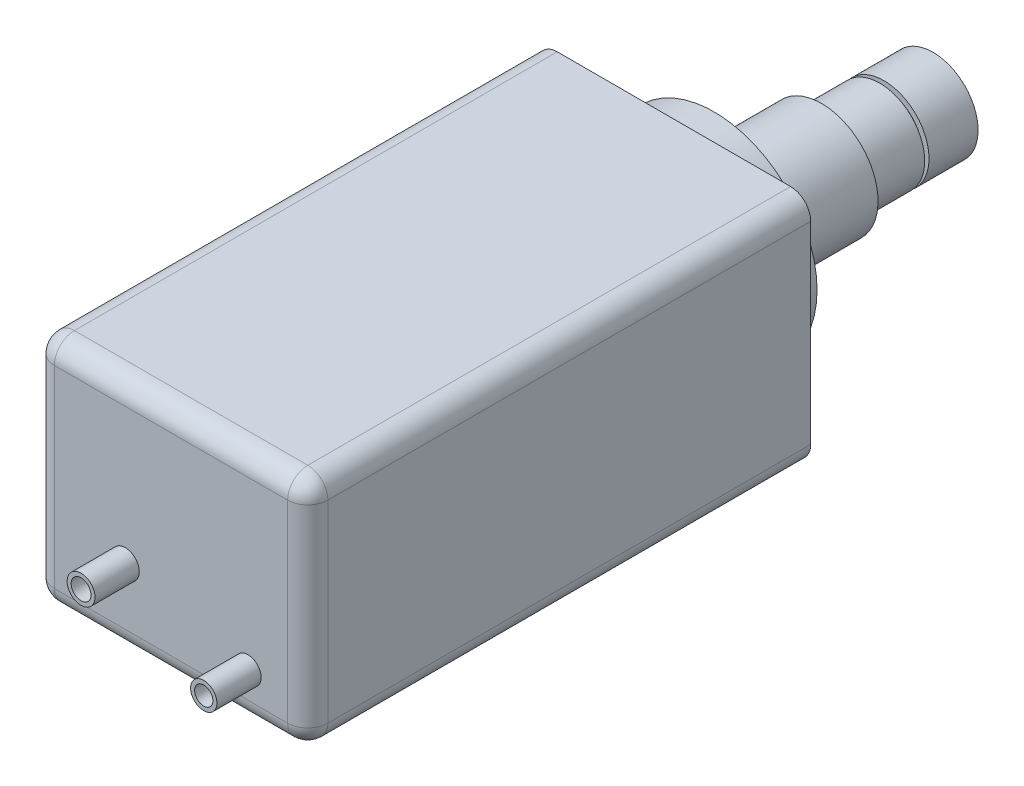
ISO-10303-21;
HEADER;
FILE_DESCRIPTION(('STEP AP214'),'2;1');
FILE_NAME('part.step','',(''),(''),'','','');
FILE_SCHEMA(('AUTOMOTIVE_DESIGN { 1 0 10303 214 1 1 1 1 }'));
ENDSEC;
DATA;
#1=APPLICATION_CONTEXT('core data for automotive mechanical design processes');
#2=APPLICATION_PROTOCOL_DEFINITION('international standard','automotive_design',2000,#1);
#3=PRODUCT_CONTEXT('',#1,'mechanical');
#4=PRODUCT('Part','Part','',(#3));
#5=PRODUCT_RELATED_PRODUCT_CATEGORY('part','',(#4));
#6=PRODUCT_DEFINITION_FORMATION('','',#4);
#7=PRODUCT_DEFINITION_CONTEXT('part definition',#1,'design');
#8=PRODUCT_DEFINITION('design','',#6,#7);
#9=PRODUCT_DEFINITION_SHAPE('','',#8);
#10=(LENGTH_UNIT() NAMED_UNIT(*) SI_UNIT(.MILLI.,.METRE.));
#11=(NAMED_UNIT(*) PLANE_ANGLE_UNIT() SI_UNIT($,.RADIAN.));
#12=(NAMED_UNIT(*) SI_UNIT($,.STERADIAN.) SOLID_ANGLE_UNIT());
#13=UNCERTAINTY_MEASURE_WITH_UNIT(LENGTH_MEASURE(1.E-05),#10,'distance_accuracy_value','');
#14=(GEOMETRIC_REPRESENTATION_CONTEXT(3) GLOBAL_UNCERTAINTY_ASSIGNED_CONTEXT((#13)) GLOBAL_UNIT_ASSIGNED_CONTEXT((#10,
#11,#12)) REPRESENTATION_CONTEXT('',''));
#15=CARTESIAN_POINT('',(0.,0.,0.));
#16=DIRECTION('',(0.,0.,1.));
#17=DIRECTION('',(1.,0.,0.));
#18=AXIS2_PLACEMENT_3D('',#15,#16,#17);
#19=CARTESIAN_POINT('',(-34.,-29.,125.));
#20=DIRECTION('',(0.,0.,1.));
#21=DIRECTION('',(1.,0.,0.));
#22=AXIS2_PLACEMENT_3D('',#19,#20,#21);
#23=PLANE('',#22);
#24=DIRECTION('',(0.,1.,0.));
#25=VECTOR('',#24,1.);
#26=CARTESIAN_POINT('',(29.,24.,125.));
#27=LINE('',#26,#25);
#28=CARTESIAN_POINT('',(29.,-24.,125.));
#29=VERTEX_POINT('',#28);
#30=CARTESIAN_POINT('',(29.,24.,125.));
#31=VERTEX_POINT('',#30);
#32=EDGE_CURVE('E302',#29,#31,#27,.T.);
#33=ORIENTED_EDGE('',*,*,#32,.T.);
#34=DIRECTION('',(-1.,0.,0.));
#35=VECTOR('',#34,1.);
#36=CARTESIAN_POINT('',(-29.,24.,125.));
#37=LINE('',#36,#35);
#38=CARTESIAN_POINT('',(-29.,24.,125.));
#39=VERTEX_POINT('',#38);
#40=EDGE_CURVE('E299',#31,#39,#37,.T.);
#41=ORIENTED_EDGE('',*,*,#40,.T.);
#42=DIRECTION('',(0.,-1.,0.));
#43=VECTOR('',#42,1.);
#44=CARTESIAN_POINT('',(-29.,-24.,125.));
#45=LINE('',#44,#43);
#46=CARTESIAN_POINT('',(-29.,-24.,125.));
#47=VERTEX_POINT('',#46);
#48=EDGE_CURVE('E306',#39,#47,#45,.T.);
#49=ORIENTED_EDGE('',*,*,#48,.T.);
#50=DIRECTION('',(1.,0.,0.));
#51=VECTOR('',#50,1.);
#52=CARTESIAN_POINT('',(29.,-24.,125.));
#53=LINE('',#52,#51);
#54=EDGE_CURVE('E304',#47,#29,#53,.T.);
#55=ORIENTED_EDGE('',*,*,#54,.T.);
#56=EDGE_LOOP('',(#33,#41,#49,#55));
#57=FACE_BOUND('',#56,.T.);
#58=CARTESIAN_POINT('',(-11.3433264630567,-9.85762463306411,125.));
#59=DIRECTION('',(0.,0.,1.));
#60=DIRECTION('',(1.,0.,0.));
#61=AXIS2_PLACEMENT_3D('',#58,#59,#60);
#62=CIRCLE('',#61,3.46742316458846);
#63=CARTESIAN_POINT('',(-7.87590329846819,-9.85762463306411,125.));
#64=VERTEX_POINT('',#63);
#65=EDGE_CURVE('E388',#64,#64,#62,.T.);
#66=ORIENTED_EDGE('',*,*,#65,.F.);
#67=EDGE_LOOP('',(#66));
#68=FACE_BOUND('',#67,.T.);
#69=CARTESIAN_POINT('',(19.1475350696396,-17.4803400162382,125.));
#70=DIRECTION('',(0.,0.,1.));
#71=DIRECTION('',(1.,0.,0.));
#72=AXIS2_PLACEMENT_3D('',#69,#70,#71);
#73=CIRCLE('',#72,3.27191561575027);
#74=CARTESIAN_POINT('',(22.4194506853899,-17.4803400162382,125.));
#75=VERTEX_POINT('',#74);
#76=EDGE_CURVE('E397',#75,#75,#73,.T.);
#77=ORIENTED_EDGE('',*,*,#76,.F.);
#78=EDGE_LOOP('',(#77));
#79=FACE_BOUND('',#78,.T.);
#80=ADVANCED_FACE('F47',(#57,#68,#79),#23,.T.);
#81=CARTESIAN_POINT('',(-34.,-29.,125.));
#82=DIRECTION('',(0.,1.,0.));
#83=DIRECTION('',(0.,0.,1.));
#84=AXIS2_PLACEMENT_3D('',#81,#82,#83);
#85=PLANE('',#84);
#86=DIRECTION('',(0.,0.,1.));
#87=VECTOR('',#86,1.);
#88=CARTESIAN_POINT('',(19.5,-29.,0.));
#89=LINE('',#88,#87);
#90=CARTESIAN_POINT('',(19.5,-29.,0.));
#91=VERTEX_POINT('',#90);
#92=CARTESIAN_POINT('',(19.5,-29.,35.5859522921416));
#93=VERTEX_POINT('',#92);
#94=EDGE_CURVE('E162',#91,#93,#89,.T.);
#95=ORIENTED_EDGE('',*,*,#94,.F.);
#96=DIRECTION('',(1.,0.,0.));
#97=VECTOR('',#96,1.);
#98=CARTESIAN_POINT('',(-34.,-29.,0.));
#99=LINE('',#98,#97);
#100=CARTESIAN_POINT('',(29.,-29.,0.));
#101=VERTEX_POINT('',#100);
#102=EDGE_CURVE('E147',#91,#101,#99,.T.);
#103=ORIENTED_EDGE('',*,*,#102,.T.);
#104=DIRECTION('',(0.,0.,-1.));
#105=VECTOR('',#104,1.);
#106=CARTESIAN_POINT('',(29.,-29.,125.));
#107=LINE('',#106,#105);
#108=CARTESIAN_POINT('',(29.,-29.,120.));
#109=VERTEX_POINT('',#108);
#110=EDGE_CURVE('E335',#101,#109,#107,.F.);
#111=ORIENTED_EDGE('',*,*,#110,.T.);
#112=DIRECTION('',(1.,0.,0.));
#113=VECTOR('',#112,1.);
#114=CARTESIAN_POINT('',(-29.,-29.,120.));
#115=LINE('',#114,#113);
#116=CARTESIAN_POINT('',(-29.,-29.,120.));
#117=VERTEX_POINT('',#116);
#118=EDGE_CURVE('E289',#109,#117,#115,.F.);
#119=ORIENTED_EDGE('',*,*,#118,.T.);
#120=DIRECTION('',(0.,0.,-1.));
#121=VECTOR('',#120,1.);
#122=CARTESIAN_POINT('',(-29.,-29.,125.));
#123=LINE('',#122,#121);
#124=CARTESIAN_POINT('',(-29.,-29.,0.));
#125=VERTEX_POINT('',#124);
#126=EDGE_CURVE('E333',#117,#125,#123,.T.);
#127=ORIENTED_EDGE('',*,*,#126,.T.);
#128=CARTESIAN_POINT('',(-19.5,-29.,0.));
#129=VERTEX_POINT('',#128);
#130=EDGE_CURVE('E158',#125,#129,#99,.T.);
#131=ORIENTED_EDGE('',*,*,#130,.T.);
#132=DIRECTION('',(0.,0.,-1.));
#133=VECTOR('',#132,1.);
#134=CARTESIAN_POINT('',(-19.5,-29.,0.));
#135=LINE('',#134,#133);
#136=CARTESIAN_POINT('',(-19.5,-29.,35.5859522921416));
#137=VERTEX_POINT('',#136);
#138=EDGE_CURVE('E67',#137,#129,#135,.T.);
#139=ORIENTED_EDGE('',*,*,#138,.F.);
#140=CARTESIAN_POINT('',(0.,-29.,26.4776652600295));
#141=DIRECTION('',(0.,-1.,0.));
#142=DIRECTION('',(0.,0.,-1.));
#143=AXIS2_PLACEMENT_3D('',#140,#141,#142);
#144=CIRCLE('',#143,21.5223347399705);
#145=EDGE_CURVE('E62',#93,#137,#144,.T.);
#146=ORIENTED_EDGE('',*,*,#145,.F.);
#147=EDGE_LOOP('',(#95,#103,#111,#119,#127,#131,#139,#146));
#148=FACE_BOUND('',#147,.T.);
#149=ADVANCED_FACE('F163',(#148),#85,.F.);
#150=CARTESIAN_POINT('',(-34.,-29.,0.));
#151=DIRECTION('',(0.,0.,1.));
#152=DIRECTION('',(1.,0.,0.));
#153=AXIS2_PLACEMENT_3D('',#150,#151,#152);
#154=PLANE('',#153);
#155=ORIENTED_EDGE('',*,*,#130,.F.);
#156=CARTESIAN_POINT('',(-29.,-24.,0.));
#157=DIRECTION('',(0.,0.,1.));
#158=DIRECTION('',(1.,0.,0.));
#159=AXIS2_PLACEMENT_3D('',#156,#157,#158);
#160=CIRCLE('',#159,5.);
#161=CARTESIAN_POINT('',(-34.,-24.,0.));
#162=VERTEX_POINT('',#161);
#163=EDGE_CURVE('E326',#125,#162,#160,.F.);
#164=ORIENTED_EDGE('',*,*,#163,.T.);
#165=DIRECTION('',(0.,-1.,0.));
#166=VECTOR('',#165,1.);
#167=CARTESIAN_POINT('',(-34.,29.,0.));
#168=LINE('',#167,#166);
#169=CARTESIAN_POINT('',(-34.,24.,0.));
#170=VERTEX_POINT('',#169);
#171=EDGE_CURVE('E159',#170,#162,#168,.T.);
#172=ORIENTED_EDGE('',*,*,#171,.F.);
#173=CARTESIAN_POINT('',(-29.,24.,0.));
#174=DIRECTION('',(0.,0.,1.));
#175=DIRECTION('',(1.,0.,0.));
#176=AXIS2_PLACEMENT_3D('',#173,#174,#175);
#177=CIRCLE('',#176,5.);
#178=CARTESIAN_POINT('',(-29.,29.,0.));
#179=VERTEX_POINT('',#178);
#180=EDGE_CURVE('E329',#170,#179,#177,.F.);
#181=ORIENTED_EDGE('',*,*,#180,.T.);
#182=DIRECTION('',(-1.,0.,0.));
#183=VECTOR('',#182,1.);
#184=CARTESIAN_POINT('',(-34.,29.,0.));
#185=LINE('',#184,#183);
#186=CARTESIAN_POINT('',(29.,29.,0.));
#187=VERTEX_POINT('',#186);
#188=EDGE_CURVE('E337',#187,#179,#185,.T.);
#189=ORIENTED_EDGE('',*,*,#188,.F.);
#190=CARTESIAN_POINT('',(29.,24.,0.));
#191=DIRECTION('',(0.,0.,1.));
#192=DIRECTION('',(1.,0.,0.));
#193=AXIS2_PLACEMENT_3D('',#190,#191,#192);
#194=CIRCLE('',#193,5.);
#195=CARTESIAN_POINT('',(34.,24.,0.));
#196=VERTEX_POINT('',#195);
#197=EDGE_CURVE('E331',#187,#196,#194,.F.);
#198=ORIENTED_EDGE('',*,*,#197,.T.);
#199=DIRECTION('',(0.,1.,0.));
#200=VECTOR('',#199,1.);
#201=CARTESIAN_POINT('',(34.,29.,0.));
#202=LINE('',#201,#200);
#203=CARTESIAN_POINT('',(34.,-24.,0.));
#204=VERTEX_POINT('',#203);
#205=EDGE_CURVE('E340',#204,#196,#202,.T.);
#206=ORIENTED_EDGE('',*,*,#205,.F.);
#207=CARTESIAN_POINT('',(29.,-24.,0.));
#208=DIRECTION('',(0.,0.,1.));
#209=DIRECTION('',(1.,0.,0.));
#210=AXIS2_PLACEMENT_3D('',#207,#208,#209);
#211=CIRCLE('',#210,5.);
#212=EDGE_CURVE('E155',#204,#101,#211,.F.);
#213=ORIENTED_EDGE('',*,*,#212,.T.);
#214=ORIENTED_EDGE('',*,*,#102,.F.);
#215=DIRECTION('',(1.,0.,0.));
#216=VECTOR('',#215,1.);
#217=CARTESIAN_POINT('',(19.5,-29.,0.));
#218=LINE('',#217,#216);
#219=EDGE_CURVE('E152',#129,#91,#218,.T.);
#220=ORIENTED_EDGE('',*,*,#219,.F.);
#221=EDGE_LOOP('',(#155,#164,#172,#181,#189,#198,#206,#213,#214,#220));
#222=FACE_BOUND('',#221,.T.);
#223=CARTESIAN_POINT('',(0.,0.,0.));
#224=DIRECTION('',(0.,0.,1.));
#225=DIRECTION('',(1.,0.,0.));
#226=AXIS2_PLACEMENT_3D('',#223,#224,#225);
#227=CIRCLE('',#226,25.5752070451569);
#228=CARTESIAN_POINT('',(25.5752070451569,0.,0.));
#229=VERTEX_POINT('',#228);
#230=EDGE_CURVE('E257',#229,#229,#227,.F.);
#231=ORIENTED_EDGE('',*,*,#230,.F.);
#232=EDGE_LOOP('',(#231));
#233=FACE_BOUND('',#232,.T.);
#234=ADVANCED_FACE('F149',(#222,#233),#154,.F.);
#235=CARTESIAN_POINT('',(-34.,29.,125.));
#236=DIRECTION('',(1.,0.,0.));
#237=DIRECTION('',(0.,1.,0.));
#238=AXIS2_PLACEMENT_3D('',#235,#236,#237);
#239=PLANE('',#238);
#240=DIRECTION('',(0.,0.,-1.));
#241=VECTOR('',#240,1.);
#242=CARTESIAN_POINT('',(-34.,-24.,125.));
#243=LINE('',#242,#241);
#244=CARTESIAN_POINT('',(-34.,-24.,120.));
#245=VERTEX_POINT('',#244);
#246=EDGE_CURVE('E321',#162,#245,#243,.F.);
#247=ORIENTED_EDGE('',*,*,#246,.T.);
#248=DIRECTION('',(0.,-1.,0.));
#249=VECTOR('',#248,1.);
#250=CARTESIAN_POINT('',(-34.,24.,120.));
#251=LINE('',#250,#249);
#252=CARTESIAN_POINT('',(-34.,24.,120.));
#253=VERTEX_POINT('',#252);
#254=EDGE_CURVE('E262',#245,#253,#251,.F.);
#255=ORIENTED_EDGE('',*,*,#254,.T.);
#256=DIRECTION('',(0.,0.,-1.));
#257=VECTOR('',#256,1.);
#258=CARTESIAN_POINT('',(-34.,24.,125.));
#259=LINE('',#258,#257);
#260=EDGE_CURVE('E324',#253,#170,#259,.T.);
#261=ORIENTED_EDGE('',*,*,#260,.T.);
#262=ORIENTED_EDGE('',*,*,#171,.T.);
#263=EDGE_LOOP('',(#247,#255,#261,#262));
#264=FACE_BOUND('',#263,.T.);
#265=ADVANCED_FACE('F499',(#264),#239,.F.);
#266=CARTESIAN_POINT('',(34.,29.,125.));
#267=DIRECTION('',(-1.,0.,0.));
#268=DIRECTION('',(0.,-1.,0.));
#269=AXIS2_PLACEMENT_3D('',#266,#267,#268);
#270=PLANE('',#269);
#271=DIRECTION('',(0.,0.,-1.));
#272=VECTOR('',#271,1.);
#273=CARTESIAN_POINT('',(34.,24.,125.));
#274=LINE('',#273,#272);
#275=CARTESIAN_POINT('',(34.,24.,120.));
#276=VERTEX_POINT('',#275);
#277=EDGE_CURVE('E318',#196,#276,#274,.F.);
#278=ORIENTED_EDGE('',*,*,#277,.T.);
#279=DIRECTION('',(0.,1.,0.));
#280=VECTOR('',#279,1.);
#281=CARTESIAN_POINT('',(34.,-24.,120.));
#282=LINE('',#281,#280);
#283=CARTESIAN_POINT('',(34.,-24.,120.));
#284=VERTEX_POINT('',#283);
#285=EDGE_CURVE('E293',#276,#284,#282,.F.);
#286=ORIENTED_EDGE('',*,*,#285,.T.);
#287=DIRECTION('',(0.,0.,-1.));
#288=VECTOR('',#287,1.);
#289=CARTESIAN_POINT('',(34.,-24.,125.));
#290=LINE('',#289,#288);
#291=EDGE_CURVE('E316',#284,#204,#290,.T.);
#292=ORIENTED_EDGE('',*,*,#291,.T.);
#293=ORIENTED_EDGE('',*,*,#205,.T.);
#294=EDGE_LOOP('',(#278,#286,#292,#293));
#295=FACE_BOUND('',#294,.T.);
#296=ADVANCED_FACE('F503',(#295),#270,.F.);
#297=CARTESIAN_POINT('',(-34.,29.,125.));
#298=DIRECTION('',(0.,-1.,0.));
#299=DIRECTION('',(0.,0.,-1.));
#300=AXIS2_PLACEMENT_3D('',#297,#298,#299);
#301=PLANE('',#300);
#302=DIRECTION('',(0.,0.,-1.));
#303=VECTOR('',#302,1.);
#304=CARTESIAN_POINT('',(-29.,29.,125.));
#305=LINE('',#304,#303);
#306=CARTESIAN_POINT('',(-29.,29.,120.));
#307=VERTEX_POINT('',#306);
#308=EDGE_CURVE('E311',#179,#307,#305,.F.);
#309=ORIENTED_EDGE('',*,*,#308,.T.);
#310=DIRECTION('',(-1.,0.,0.));
#311=VECTOR('',#310,1.);
#312=CARTESIAN_POINT('',(29.,29.,120.));
#313=LINE('',#312,#311);
#314=CARTESIAN_POINT('',(29.,29.,120.));
#315=VERTEX_POINT('',#314);
#316=EDGE_CURVE('E297',#307,#315,#313,.F.);
#317=ORIENTED_EDGE('',*,*,#316,.T.);
#318=DIRECTION('',(0.,0.,-1.));
#319=VECTOR('',#318,1.);
#320=CARTESIAN_POINT('',(29.,29.,125.));
#321=LINE('',#320,#319);
#322=EDGE_CURVE('E314',#315,#187,#321,.T.);
#323=ORIENTED_EDGE('',*,*,#322,.T.);
#324=ORIENTED_EDGE('',*,*,#188,.T.);
#325=EDGE_LOOP('',(#309,#317,#323,#324));
#326=FACE_BOUND('',#325,.T.);
#327=ADVANCED_FACE('F507',(#326),#301,.F.);
#328=CARTESIAN_POINT('',(-29.,-24.,125.));
#329=DIRECTION('',(0.,0.,-1.));
#330=DIRECTION('',(-1.,0.,0.));
#331=AXIS2_PLACEMENT_3D('',#328,#329,#330);
#332=CYLINDRICAL_SURFACE('',#331,5.);
#333=ORIENTED_EDGE('',*,*,#126,.F.);
#334=CARTESIAN_POINT('',(-29.,-24.,120.));
#335=DIRECTION('',(0.,0.,-1.));
#336=DIRECTION('',(-1.,0.,0.));
#337=AXIS2_PLACEMENT_3D('',#334,#335,#336);
#338=CIRCLE('',#337,5.);
#339=EDGE_CURVE('E287',#117,#245,#338,.T.);
#340=ORIENTED_EDGE('',*,*,#339,.T.);
#341=ORIENTED_EDGE('',*,*,#246,.F.);
#342=ORIENTED_EDGE('',*,*,#163,.F.);
#343=EDGE_LOOP('',(#333,#340,#341,#342));
#344=FACE_BOUND('',#343,.T.);
#345=ADVANCED_FACE('F510',(#344),#332,.T.);
#346=CARTESIAN_POINT('',(29.,-24.,125.));
#347=DIRECTION('',(0.,0.,-1.));
#348=DIRECTION('',(-1.,0.,0.));
#349=AXIS2_PLACEMENT_3D('',#346,#347,#348);
#350=CYLINDRICAL_SURFACE('',#349,5.);
#351=ORIENTED_EDGE('',*,*,#291,.F.);
#352=CARTESIAN_POINT('',(29.,-24.,120.));
#353=DIRECTION('',(0.,0.,-1.));
#354=DIRECTION('',(-1.,0.,0.));
#355=AXIS2_PLACEMENT_3D('',#352,#353,#354);
#356=CIRCLE('',#355,5.);
#357=EDGE_CURVE('E291',#284,#109,#356,.T.);
#358=ORIENTED_EDGE('',*,*,#357,.T.);
#359=ORIENTED_EDGE('',*,*,#110,.F.);
#360=ORIENTED_EDGE('',*,*,#212,.F.);
#361=EDGE_LOOP('',(#351,#358,#359,#360));
#362=FACE_BOUND('',#361,.T.);
#363=ADVANCED_FACE('F517',(#362),#350,.T.);
#364=CARTESIAN_POINT('',(-29.,24.,125.));
#365=DIRECTION('',(0.,0.,-1.));
#366=DIRECTION('',(-1.,0.,0.));
#367=AXIS2_PLACEMENT_3D('',#364,#365,#366);
#368=CYLINDRICAL_SURFACE('',#367,5.);
#369=ORIENTED_EDGE('',*,*,#260,.F.);
#370=CARTESIAN_POINT('',(-29.,24.,120.));
#371=DIRECTION('',(0.,0.,-1.));
#372=DIRECTION('',(-1.,0.,0.));
#373=AXIS2_PLACEMENT_3D('',#370,#371,#372);
#374=CIRCLE('',#373,5.);
#375=EDGE_CURVE('E308',#253,#307,#374,.T.);
#376=ORIENTED_EDGE('',*,*,#375,.T.);
#377=ORIENTED_EDGE('',*,*,#308,.F.);
#378=ORIENTED_EDGE('',*,*,#180,.F.);
#379=EDGE_LOOP('',(#369,#376,#377,#378));
#380=FACE_BOUND('',#379,.T.);
#381=ADVANCED_FACE('F521',(#380),#368,.T.);
#382=CARTESIAN_POINT('',(29.,24.,125.));
#383=DIRECTION('',(0.,0.,-1.));
#384=DIRECTION('',(-1.,0.,0.));
#385=AXIS2_PLACEMENT_3D('',#382,#383,#384);
#386=CYLINDRICAL_SURFACE('',#385,5.);
#387=ORIENTED_EDGE('',*,*,#322,.F.);
#388=CARTESIAN_POINT('',(29.,24.,120.));
#389=DIRECTION('',(0.,0.,-1.));
#390=DIRECTION('',(-1.,0.,0.));
#391=AXIS2_PLACEMENT_3D('',#388,#389,#390);
#392=CIRCLE('',#391,5.);
#393=EDGE_CURVE('E295',#315,#276,#392,.T.);
#394=ORIENTED_EDGE('',*,*,#393,.T.);
#395=ORIENTED_EDGE('',*,*,#277,.F.);
#396=ORIENTED_EDGE('',*,*,#197,.F.);
#397=EDGE_LOOP('',(#387,#394,#395,#396));
#398=FACE_BOUND('',#397,.T.);
#399=ADVANCED_FACE('F525',(#398),#386,.T.);
#400=CARTESIAN_POINT('',(29.,-24.,120.));
#401=DIRECTION('',(0.,0.,1.));
#402=DIRECTION('',(1.,0.,0.));
#403=AXIS2_PLACEMENT_3D('',#400,#401,#402);
#404=SPHERICAL_SURFACE('',#403,5.);
#405=CARTESIAN_POINT('',(29.,-24.,120.));
#406=DIRECTION('',(-1.,0.,0.));
#407=DIRECTION('',(0.,-1.,0.));
#408=AXIS2_PLACEMENT_3D('',#405,#406,#407);
#409=CIRCLE('',#408,5.);
#410=EDGE_CURVE('E266',#109,#29,#409,.T.);
#411=ORIENTED_EDGE('',*,*,#410,.F.);
#412=ORIENTED_EDGE('',*,*,#357,.F.);
#413=CARTESIAN_POINT('',(29.,-24.,120.));
#414=DIRECTION('',(0.,1.,0.));
#415=DIRECTION('',(0.,0.,1.));
#416=AXIS2_PLACEMENT_3D('',#413,#414,#415);
#417=CIRCLE('',#416,5.);
#418=EDGE_CURVE('E263',#29,#284,#417,.T.);
#419=ORIENTED_EDGE('',*,*,#418,.F.);
#420=EDGE_LOOP('',(#411,#412,#419));
#421=FACE_BOUND('',#420,.T.);
#422=ADVANCED_FACE('F49',(#421),#404,.T.);
#423=CARTESIAN_POINT('',(29.,-29.,120.));
#424=DIRECTION('',(0.,-1.,0.));
#425=DIRECTION('',(1.,0.,0.));
#426=AXIS2_PLACEMENT_3D('',#423,#424,#425);
#427=CYLINDRICAL_SURFACE('',#426,5.);
#428=ORIENTED_EDGE('',*,*,#418,.T.);
#429=ORIENTED_EDGE('',*,*,#285,.F.);
#430=CARTESIAN_POINT('',(29.,24.,120.));
#431=DIRECTION('',(0.,1.,0.));
#432=DIRECTION('',(0.,0.,1.));
#433=AXIS2_PLACEMENT_3D('',#430,#431,#432);
#434=CIRCLE('',#433,5.);
#435=EDGE_CURVE('E269',#31,#276,#434,.T.);
#436=ORIENTED_EDGE('',*,*,#435,.F.);
#437=ORIENTED_EDGE('',*,*,#32,.F.);
#438=EDGE_LOOP('',(#428,#429,#436,#437));
#439=FACE_BOUND('',#438,.T.);
#440=ADVANCED_FACE('F547',(#439),#427,.T.);
#441=CARTESIAN_POINT('',(-34.,-24.,120.));
#442=DIRECTION('',(-1.,0.,0.));
#443=DIRECTION('',(0.,0.,1.));
#444=AXIS2_PLACEMENT_3D('',#441,#442,#443);
#445=CYLINDRICAL_SURFACE('',#444,5.);
#446=ORIENTED_EDGE('',*,*,#410,.T.);
#447=ORIENTED_EDGE('',*,*,#54,.F.);
#448=CARTESIAN_POINT('',(-29.,-24.,120.));
#449=DIRECTION('',(-1.,0.,0.));
#450=DIRECTION('',(0.,0.,1.));
#451=AXIS2_PLACEMENT_3D('',#448,#449,#450);
#452=CIRCLE('',#451,5.);
#453=EDGE_CURVE('E272',#117,#47,#452,.T.);
#454=ORIENTED_EDGE('',*,*,#453,.F.);
#455=ORIENTED_EDGE('',*,*,#118,.F.);
#456=EDGE_LOOP('',(#446,#447,#454,#455));
#457=FACE_BOUND('',#456,.T.);
#458=ADVANCED_FACE('F544',(#457),#445,.T.);
#459=CARTESIAN_POINT('',(29.,24.,120.));
#460=DIRECTION('',(0.,0.,1.));
#461=DIRECTION('',(1.,0.,0.));
#462=AXIS2_PLACEMENT_3D('',#459,#460,#461);
#463=SPHERICAL_SURFACE('',#462,5.);
#464=ORIENTED_EDGE('',*,*,#435,.T.);
#465=ORIENTED_EDGE('',*,*,#393,.F.);
#466=CARTESIAN_POINT('',(29.,24.,120.));
#467=DIRECTION('',(-1.,0.,0.));
#468=DIRECTION('',(0.,0.,1.));
#469=AXIS2_PLACEMENT_3D('',#466,#467,#468);
#470=CIRCLE('',#469,5.);
#471=EDGE_CURVE('E275',#31,#315,#470,.T.);
#472=ORIENTED_EDGE('',*,*,#471,.F.);
#473=EDGE_LOOP('',(#464,#465,#472));
#474=FACE_BOUND('',#473,.T.);
#475=ADVANCED_FACE('F540',(#474),#463,.T.);
#476=CARTESIAN_POINT('',(-29.,-24.,120.));
#477=DIRECTION('',(0.,0.,1.));
#478=DIRECTION('',(1.,0.,0.));
#479=AXIS2_PLACEMENT_3D('',#476,#477,#478);
#480=SPHERICAL_SURFACE('',#479,5.);
#481=ORIENTED_EDGE('',*,*,#339,.F.);
#482=ORIENTED_EDGE('',*,*,#453,.T.);
#483=CARTESIAN_POINT('',(-29.,-24.,120.));
#484=DIRECTION('',(0.,1.,0.));
#485=DIRECTION('',(-1.,0.,0.));
#486=AXIS2_PLACEMENT_3D('',#483,#484,#485);
#487=CIRCLE('',#486,5.);
#488=EDGE_CURVE('E278',#245,#47,#487,.T.);
#489=ORIENTED_EDGE('',*,*,#488,.F.);
#490=EDGE_LOOP('',(#481,#482,#489));
#491=FACE_BOUND('',#490,.T.);
#492=ADVANCED_FACE('F536',(#491),#480,.T.);
#493=CARTESIAN_POINT('',(-34.,24.,120.));
#494=DIRECTION('',(1.,0.,0.));
#495=DIRECTION('',(0.,0.,-1.));
#496=AXIS2_PLACEMENT_3D('',#493,#494,#495);
#497=CYLINDRICAL_SURFACE('',#496,5.);
#498=ORIENTED_EDGE('',*,*,#471,.T.);
#499=ORIENTED_EDGE('',*,*,#316,.F.);
#500=CARTESIAN_POINT('',(-29.,24.,120.));
#501=DIRECTION('',(-1.,0.,0.));
#502=DIRECTION('',(0.,0.,1.));
#503=AXIS2_PLACEMENT_3D('',#500,#501,#502);
#504=CIRCLE('',#503,5.);
#505=EDGE_CURVE('E281',#39,#307,#504,.T.);
#506=ORIENTED_EDGE('',*,*,#505,.F.);
#507=ORIENTED_EDGE('',*,*,#40,.F.);
#508=EDGE_LOOP('',(#498,#499,#506,#507));
#509=FACE_BOUND('',#508,.T.);
#510=ADVANCED_FACE('F532',(#509),#497,.T.);
#511=CARTESIAN_POINT('',(-29.,-29.,120.));
#512=DIRECTION('',(0.,1.,0.));
#513=DIRECTION('',(-1.,0.,0.));
#514=AXIS2_PLACEMENT_3D('',#511,#512,#513);
#515=CYLINDRICAL_SURFACE('',#514,5.);
#516=ORIENTED_EDGE('',*,*,#488,.T.);
#517=ORIENTED_EDGE('',*,*,#48,.F.);
#518=CARTESIAN_POINT('',(-29.,24.,120.));
#519=DIRECTION('',(0.,1.,0.));
#520=DIRECTION('',(0.,0.,1.));
#521=AXIS2_PLACEMENT_3D('',#518,#519,#520);
#522=CIRCLE('',#521,5.);
#523=EDGE_CURVE('E283',#253,#39,#522,.T.);
#524=ORIENTED_EDGE('',*,*,#523,.F.);
#525=ORIENTED_EDGE('',*,*,#254,.F.);
#526=EDGE_LOOP('',(#516,#517,#524,#525));
#527=FACE_BOUND('',#526,.T.);
#528=ADVANCED_FACE('F492',(#527),#515,.T.);
#529=CARTESIAN_POINT('',(-29.,24.,120.));
#530=DIRECTION('',(0.,0.,1.));
#531=DIRECTION('',(1.,0.,0.));
#532=AXIS2_PLACEMENT_3D('',#529,#530,#531);
#533=SPHERICAL_SURFACE('',#532,5.);
#534=ORIENTED_EDGE('',*,*,#505,.T.);
#535=ORIENTED_EDGE('',*,*,#375,.F.);
#536=ORIENTED_EDGE('',*,*,#523,.T.);
#537=EDGE_LOOP('',(#534,#535,#536));
#538=FACE_BOUND('',#537,.T.);
#539=ADVANCED_FACE('F487',(#538),#533,.T.);
#540=CARTESIAN_POINT('',(0.,0.,-10.));
#541=DIRECTION('',(0.,0.,1.));
#542=DIRECTION('',(1.,0.,0.));
#543=AXIS2_PLACEMENT_3D('',#540,#541,#542);
#544=CYLINDRICAL_SURFACE('',#543,25.5752070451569);
#545=CARTESIAN_POINT('',(0.,0.,-10.));
#546=DIRECTION('',(0.,0.,-1.));
#547=DIRECTION('',(-1.,0.,0.));
#548=AXIS2_PLACEMENT_3D('',#545,#546,#547);
#549=CIRCLE('',#548,25.5752070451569);
#550=CARTESIAN_POINT('',(-25.5752070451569,0.,-10.));
#551=VERTEX_POINT('',#550);
#552=EDGE_CURVE('E285',#551,#551,#549,.T.);
#553=ORIENTED_EDGE('',*,*,#552,.F.);
#554=EDGE_LOOP('',(#553));
#555=FACE_BOUND('',#554,.T.);
#556=ORIENTED_EDGE('',*,*,#230,.T.);
#557=EDGE_LOOP('',(#556));
#558=FACE_BOUND('',#557,.T.);
#559=ADVANCED_FACE('F484',(#555,#558),#544,.T.);
#560=CARTESIAN_POINT('',(0.,0.,-10.));
#561=DIRECTION('',(0.,0.,-1.));
#562=DIRECTION('',(-1.,0.,0.));
#563=AXIS2_PLACEMENT_3D('',#560,#561,#562);
#564=PLANE('',#563);
#565=CARTESIAN_POINT('',(0.,0.,-10.));
#566=DIRECTION('',(0.,0.,-1.));
#567=DIRECTION('',(-1.,0.,0.));
#568=AXIS2_PLACEMENT_3D('',#565,#566,#567);
#569=CIRCLE('',#568,14.0393650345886);
#570=CARTESIAN_POINT('',(-14.0393650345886,0.,-10.));
#571=VERTEX_POINT('',#570);
#572=EDGE_CURVE('E255',#571,#571,#569,.T.);
#573=ORIENTED_EDGE('',*,*,#572,.F.);
#574=EDGE_LOOP('',(#573));
#575=FACE_BOUND('',#574,.T.);
#576=ORIENTED_EDGE('',*,*,#552,.T.);
#577=EDGE_LOOP('',(#576));
#578=FACE_BOUND('',#577,.T.);
#579=ADVANCED_FACE('F481',(#575,#578),#564,.T.);
#580=CARTESIAN_POINT('',(0.,0.,-64.3966843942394));
#581=DIRECTION('',(0.,0.,-1.));
#582=DIRECTION('',(-1.,0.,0.));
#583=AXIS2_PLACEMENT_3D('',#580,#581,#582);
#584=CYLINDRICAL_SURFACE('',#583,14.0393650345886);
#585=ORIENTED_EDGE('',*,*,#572,.T.);
#586=EDGE_LOOP('',(#585));
#587=FACE_BOUND('',#586,.T.);
#588=CARTESIAN_POINT('',(0.,0.,-36.6944750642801));
#589=DIRECTION('',(0.,0.,-1.));
#590=DIRECTION('',(-1.,0.,0.));
#591=AXIS2_PLACEMENT_3D('',#588,#589,#590);
#592=CIRCLE('',#591,14.0393650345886);
#593=CARTESIAN_POINT('',(-14.0393650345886,0.,-36.6944750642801));
#594=VERTEX_POINT('',#593);
#595=EDGE_CURVE('E347',#594,#594,#592,.T.);
#596=ORIENTED_EDGE('',*,*,#595,.F.);
#597=EDGE_LOOP('',(#596));
#598=FACE_BOUND('',#597,.T.);
#599=ADVANCED_FACE('F477',(#587,#598),#584,.T.);
#600=CARTESIAN_POINT('',(-14.0393650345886,0.,-36.6944750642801));
#601=DIRECTION('',(0.,0.,-1.));
#602=DIRECTION('',(-1.,0.,0.));
#603=AXIS2_PLACEMENT_3D('',#600,#601,#602);
#604=PLANE('',#603);
#605=ORIENTED_EDGE('',*,*,#595,.T.);
#606=EDGE_LOOP('',(#605));
#607=FACE_BOUND('',#606,.T.);
#608=CARTESIAN_POINT('',(0.,0.,-36.6944750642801));
#609=DIRECTION('',(0.,0.,-1.));
#610=DIRECTION('',(-1.,0.,0.));
#611=AXIS2_PLACEMENT_3D('',#608,#609,#610);
#612=CIRCLE('',#611,11.197963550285);
#613=CARTESIAN_POINT('',(-11.197963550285,0.,-36.6944750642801));
#614=VERTEX_POINT('',#613);
#615=EDGE_CURVE('E350',#614,#614,#612,.T.);
#616=ORIENTED_EDGE('',*,*,#615,.F.);
#617=EDGE_LOOP('',(#616));
#618=FACE_BOUND('',#617,.T.);
#619=ADVANCED_FACE('F473',(#607,#618),#604,.T.);
#620=CARTESIAN_POINT('',(0.,0.,-64.3966843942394));
#621=DIRECTION('',(0.,0.,-1.));
#622=DIRECTION('',(-1.,0.,0.));
#623=AXIS2_PLACEMENT_3D('',#620,#621,#622);
#624=CYLINDRICAL_SURFACE('',#623,11.197963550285);
#625=ORIENTED_EDGE('',*,*,#615,.T.);
#626=EDGE_LOOP('',(#625));
#627=FACE_BOUND('',#626,.T.);
#628=CARTESIAN_POINT('',(0.,0.,-51.1349275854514));
#629=DIRECTION('',(0.,0.,-1.));
#630=DIRECTION('',(-1.,0.,0.));
#631=AXIS2_PLACEMENT_3D('',#628,#629,#630);
#632=CIRCLE('',#631,11.197963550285);
#633=CARTESIAN_POINT('',(-11.197963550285,0.,-51.1349275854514));
#634=VERTEX_POINT('',#633);
#635=EDGE_CURVE('E353',#634,#634,#632,.T.);
#636=ORIENTED_EDGE('',*,*,#635,.F.);
#637=EDGE_LOOP('',(#636));
#638=FACE_BOUND('',#637,.T.);
#639=ADVANCED_FACE('F469',(#627,#638),#624,.T.);
#640=CARTESIAN_POINT('',(-11.197963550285,0.,-51.1349275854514));
#641=DIRECTION('',(0.,0.,-1.));
#642=DIRECTION('',(-1.,0.,0.));
#643=AXIS2_PLACEMENT_3D('',#640,#641,#642);
#644=PLANE('',#643);
#645=ORIENTED_EDGE('',*,*,#635,.T.);
#646=EDGE_LOOP('',(#645));
#647=FACE_BOUND('',#646,.T.);
#648=CARTESIAN_POINT('',(0.,0.,-51.1349275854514));
#649=DIRECTION('',(0.,0.,-1.));
#650=DIRECTION('',(-1.,0.,0.));
#651=AXIS2_PLACEMENT_3D('',#648,#649,#650);
#652=CIRCLE('',#651,9.7546718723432);
#653=CARTESIAN_POINT('',(-9.7546718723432,0.,-51.1349275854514));
#654=VERTEX_POINT('',#653);
#655=EDGE_CURVE('E356',#654,#654,#652,.T.);
#656=ORIENTED_EDGE('',*,*,#655,.F.);
#657=EDGE_LOOP('',(#656));
#658=FACE_BOUND('',#657,.T.);
#659=ADVANCED_FACE('F465',(#647,#658),#644,.T.);
#660=CARTESIAN_POINT('',(0.,0.,-64.3966843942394));
#661=DIRECTION('',(0.,0.,-1.));
#662=DIRECTION('',(-1.,0.,0.));
#663=AXIS2_PLACEMENT_3D('',#660,#661,#662);
#664=CYLINDRICAL_SURFACE('',#663,9.7546718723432);
#665=ORIENTED_EDGE('',*,*,#655,.T.);
#666=EDGE_LOOP('',(#665));
#667=FACE_BOUND('',#666,.T.);
#668=CARTESIAN_POINT('',(0.,0.,-52.1986019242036));
#669=DIRECTION('',(0.,0.,-1.));
#670=DIRECTION('',(-1.,0.,0.));
#671=AXIS2_PLACEMENT_3D('',#668,#669,#670);
#672=CIRCLE('',#671,9.7546718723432);
#673=CARTESIAN_POINT('',(-9.7546718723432,0.,-52.1986019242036));
#674=VERTEX_POINT('',#673);
#675=EDGE_CURVE('E359',#674,#674,#672,.T.);
#676=ORIENTED_EDGE('',*,*,#675,.F.);
#677=EDGE_LOOP('',(#676));
#678=FACE_BOUND('',#677,.T.);
#679=ADVANCED_FACE('F461',(#667,#678),#664,.T.);
#680=CARTESIAN_POINT('',(-9.7546718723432,0.,-52.1986019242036));
#681=DIRECTION('',(0.,0.,1.));
#682=DIRECTION('',(1.,0.,0.));
#683=AXIS2_PLACEMENT_3D('',#680,#681,#682);
#684=PLANE('',#683);
#685=ORIENTED_EDGE('',*,*,#675,.T.);
#686=EDGE_LOOP('',(#685));
#687=FACE_BOUND('',#686,.T.);
#688=CARTESIAN_POINT('',(0.,0.,-52.1986019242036));
#689=DIRECTION('',(0.,0.,-1.));
#690=DIRECTION('',(-1.,0.,0.));
#691=AXIS2_PLACEMENT_3D('',#688,#689,#690);
#692=CIRCLE('',#691,11.197963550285);
#693=CARTESIAN_POINT('',(-11.197963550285,0.,-52.1986019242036));
#694=VERTEX_POINT('',#693);
#695=EDGE_CURVE('E362',#694,#694,#692,.T.);
#696=ORIENTED_EDGE('',*,*,#695,.F.);
#697=EDGE_LOOP('',(#696));
#698=FACE_BOUND('',#697,.T.);
#699=ADVANCED_FACE('F457',(#687,#698),#684,.T.);
#700=CARTESIAN_POINT('',(0.,0.,-64.3966843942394));
#701=DIRECTION('',(0.,0.,-1.));
#702=DIRECTION('',(-1.,0.,0.));
#703=AXIS2_PLACEMENT_3D('',#700,#701,#702);
#704=CYLINDRICAL_SURFACE('',#703,11.197963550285);
#705=ORIENTED_EDGE('',*,*,#695,.T.);
#706=EDGE_LOOP('',(#705));
#707=FACE_BOUND('',#706,.T.);
#708=CARTESIAN_POINT('',(0.,0.,-64.3966843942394));
#709=DIRECTION('',(0.,0.,-1.));
#710=DIRECTION('',(-1.,0.,0.));
#711=AXIS2_PLACEMENT_3D('',#708,#709,#710);
#712=CIRCLE('',#711,11.197963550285);
#713=CARTESIAN_POINT('',(-11.197963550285,0.,-64.3966843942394));
#714=VERTEX_POINT('',#713);
#715=EDGE_CURVE('E365',#714,#714,#712,.T.);
#716=ORIENTED_EDGE('',*,*,#715,.F.);
#717=EDGE_LOOP('',(#716));
#718=FACE_BOUND('',#717,.T.);
#719=ADVANCED_FACE('F220',(#707,#718),#704,.T.);
#720=CARTESIAN_POINT('',(-11.197963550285,0.,-64.3966843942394));
#721=DIRECTION('',(0.,0.,-1.));
#722=DIRECTION('',(-1.,0.,0.));
#723=AXIS2_PLACEMENT_3D('',#720,#721,#722);
#724=PLANE('',#723);
#725=ORIENTED_EDGE('',*,*,#715,.T.);
#726=EDGE_LOOP('',(#725));
#727=FACE_BOUND('',#726,.T.);
#728=ADVANCED_FACE('F216',(#727),#724,.T.);
#729=CARTESIAN_POINT('',(19.5,-29.,0.));
#730=DIRECTION('',(0.981627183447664,-0.190808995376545,0.));
#731=DIRECTION('',(0.190808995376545,0.981627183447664,0.));
#732=AXIS2_PLACEMENT_3D('',#729,#730,#731);
#733=PLANE('',#732);
#734=ORIENTED_EDGE('',*,*,#94,.T.);
#735=CARTESIAN_POINT('',(16.9730559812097,-42.,35.0064541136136));
#736=CARTESIAN_POINT('',(17.1836208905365,-40.9167374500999,35.0563823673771));
#737=CARTESIAN_POINT('',(17.3941895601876,-39.8334555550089,35.105874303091));
#738=CARTESIAN_POINT('',(17.8153338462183,-37.666856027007,35.2040268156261));
#739=CARTESIAN_POINT('',(18.0259094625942,-36.5835383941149,35.2526873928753));
#740=CARTESIAN_POINT('',(18.4470672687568,-34.4168693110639,35.3492185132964));
#741=CARTESIAN_POINT('',(18.6576494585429,-33.3335178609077,35.3970890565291));
#742=CARTESIAN_POINT('',(19.0788201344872,-31.1667825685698,35.4920766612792));
#743=CARTESIAN_POINT('',(19.2894086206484,-30.0833987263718,35.5391937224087));
#744=CARTESIAN_POINT('',(19.5,-29.,35.5859522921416));
#745=B_SPLINE_CURVE_WITH_KNOTS('',3,(#735,#736,#737,#738,#739,#740,#741,#742,#743,#744),
.UNSPECIFIED.,.F.,.F.,(4,2,2,2,4),(0.,3.31399948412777,6.62799726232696,9.94199478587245,
13.2559940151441),.UNSPECIFIED.);
#746=CARTESIAN_POINT('',(16.9730559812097,-42.,35.0064541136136));
#747=VERTEX_POINT('',#746);
#748=EDGE_CURVE('E189',#747,#93,#745,.T.);
#749=ORIENTED_EDGE('',*,*,#748,.F.);
#750=DIRECTION('',(0.,0.,-1.));
#751=VECTOR('',#750,1.);
#752=CARTESIAN_POINT('',(16.9730559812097,-42.,0.));
#753=LINE('',#752,#751);
#754=CARTESIAN_POINT('',(16.9730559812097,-42.,2.52694401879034));
#755=VERTEX_POINT('',#754);
#756=EDGE_CURVE('E178',#755,#747,#753,.F.);
#757=ORIENTED_EDGE('',*,*,#756,.F.);
#758=DIRECTION('',(0.187427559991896,0.964231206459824,-0.187427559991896));
#759=VECTOR('',#758,1.);
#760=CARTESIAN_POINT('',(19.5,-29.,0.));
#761=LINE('',#760,#759);
#762=EDGE_CURVE('E174',#755,#91,#761,.T.);
#763=ORIENTED_EDGE('',*,*,#762,.T.);
#764=EDGE_LOOP('',(#734,#749,#757,#763));
#765=FACE_BOUND('',#764,.T.);
#766=ADVANCED_FACE('F180',(#765),#733,.T.);
#767=CARTESIAN_POINT('',(0.,-29.,26.4776652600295));
#768=DIRECTION('',(0.,1.,0.));
#769=DIRECTION('',(0.,0.,-1.));
#770=AXIS2_PLACEMENT_3D('',#767,#768,#769);
#771=CONICAL_SURFACE('',#770,21.5223347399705,0.191986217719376);
#772=ORIENTED_EDGE('',*,*,#145,.T.);
#773=CARTESIAN_POINT('',(-16.9730559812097,-42.,35.0064541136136));
#774=CARTESIAN_POINT('',(-17.1836208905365,-40.9167374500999,35.0563823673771));
#775=CARTESIAN_POINT('',(-17.3941895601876,-39.8334555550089,35.105874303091));
#776=CARTESIAN_POINT('',(-17.8153338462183,-37.666856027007,35.2040268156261));
#777=CARTESIAN_POINT('',(-18.0259094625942,-36.5835383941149,35.2526873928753));
#778=CARTESIAN_POINT('',(-18.4470672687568,-34.4168693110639,35.3492185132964));
#779=CARTESIAN_POINT('',(-18.6576494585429,-33.3335178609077,35.3970890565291));
#780=CARTESIAN_POINT('',(-19.0788201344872,-31.1667825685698,35.4920766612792));
#781=CARTESIAN_POINT('',(-19.2894086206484,-30.0833987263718,35.5391937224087));
#782=CARTESIAN_POINT('',(-19.5,-29.,35.5859522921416));
#783=B_SPLINE_CURVE_WITH_KNOTS('',3,(#773,#774,#775,#776,#777,#778,#779,#780,#781,#782),
.UNSPECIFIED.,.F.,.F.,(4,2,2,2,4),(0.,3.31399948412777,6.62799726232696,9.94199478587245,
13.2559940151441),.UNSPECIFIED.);
#784=CARTESIAN_POINT('',(-16.9730559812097,-42.,35.0064541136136));
#785=VERTEX_POINT('',#784);
#786=EDGE_CURVE('E184',#785,#137,#783,.T.);
#787=ORIENTED_EDGE('',*,*,#786,.F.);
#788=CARTESIAN_POINT('',(0.,-42.,26.4776652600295));
#789=DIRECTION('',(0.,-1.,0.));
#790=DIRECTION('',(0.,0.,-1.));
#791=AXIS2_PLACEMENT_3D('',#788,#789,#790);
#792=CIRCLE('',#791,18.9953907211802);
#793=EDGE_CURVE('E368',#747,#785,#792,.T.);
#794=ORIENTED_EDGE('',*,*,#793,.F.);
#795=ORIENTED_EDGE('',*,*,#748,.T.);
#796=EDGE_LOOP('',(#772,#787,#794,#795));
#797=FACE_BOUND('',#796,.T.);
#798=ADVANCED_FACE('F206',(#797),#771,.T.);
#799=CARTESIAN_POINT('',(-19.5,-29.,0.));
#800=DIRECTION('',(-0.981627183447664,-0.190808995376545,0.));
#801=DIRECTION('',(0.190808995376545,-0.981627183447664,0.));
#802=AXIS2_PLACEMENT_3D('',#799,#800,#801);
#803=PLANE('',#802);
#804=ORIENTED_EDGE('',*,*,#138,.T.);
#805=DIRECTION('',(-0.187427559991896,0.964231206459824,-0.187427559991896));
#806=VECTOR('',#805,1.);
#807=CARTESIAN_POINT('',(-18.1299654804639,-36.0482165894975,1.37003451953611));
#808=LINE('',#807,#806);
#809=CARTESIAN_POINT('',(-16.9730559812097,-42.,2.52694401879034));
#810=VERTEX_POINT('',#809);
#811=EDGE_CURVE('E177',#810,#129,#808,.T.);
#812=ORIENTED_EDGE('',*,*,#811,.F.);
#813=DIRECTION('',(0.,0.,1.));
#814=VECTOR('',#813,1.);
#815=CARTESIAN_POINT('',(-16.9730559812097,-42.,0.));
#816=LINE('',#815,#814);
#817=EDGE_CURVE('E186',#785,#810,#816,.F.);
#818=ORIENTED_EDGE('',*,*,#817,.F.);
#819=ORIENTED_EDGE('',*,*,#786,.T.);
#820=EDGE_LOOP('',(#804,#812,#818,#819));
#821=FACE_BOUND('',#820,.T.);
#822=ADVANCED_FACE('F203',(#821),#803,.T.);
#823=CARTESIAN_POINT('',(19.5,-29.,0.));
#824=DIRECTION('',(0.,-0.190808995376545,-0.981627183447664));
#825=DIRECTION('',(0.,0.981627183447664,-0.190808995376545));
#826=AXIS2_PLACEMENT_3D('',#823,#824,#825);
#827=PLANE('',#826);
#828=ORIENTED_EDGE('',*,*,#219,.T.);
#829=ORIENTED_EDGE('',*,*,#762,.F.);
#830=DIRECTION('',(-1.,0.,0.));
#831=VECTOR('',#830,1.);
#832=CARTESIAN_POINT('',(19.5,-42.,2.52694401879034));
#833=LINE('',#832,#831);
#834=EDGE_CURVE('E182',#810,#755,#833,.F.);
#835=ORIENTED_EDGE('',*,*,#834,.F.);
#836=ORIENTED_EDGE('',*,*,#811,.T.);
#837=EDGE_LOOP('',(#828,#829,#835,#836));
#838=FACE_BOUND('',#837,.T.);
#839=ADVANCED_FACE('F172',(#838),#827,.T.);
#840=CARTESIAN_POINT('',(0.,-42.,26.4776652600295));
#841=DIRECTION('',(0.,-1.,0.));
#842=DIRECTION('',(0.,0.,-1.));
#843=AXIS2_PLACEMENT_3D('',#840,#841,#842);
#844=PLANE('',#843);
#845=CARTESIAN_POINT('',(0.,-42.,22.));
#846=DIRECTION('',(0.,-1.,0.));
#847=DIRECTION('',(0.,0.,-1.));
#848=AXIS2_PLACEMENT_3D('',#845,#846,#847);
#849=CIRCLE('',#848,2.);
#850=CARTESIAN_POINT('',(0.,-42.,20.));
#851=VERTEX_POINT('',#850);
#852=EDGE_CURVE('E382',#851,#851,#849,.T.);
#853=ORIENTED_EDGE('',*,*,#852,.F.);
#854=EDGE_LOOP('',(#853));
#855=FACE_BOUND('',#854,.T.);
#856=CARTESIAN_POINT('',(0.,-42.,40.));
#857=DIRECTION('',(0.,-1.,0.));
#858=DIRECTION('',(0.,0.,-1.));
#859=AXIS2_PLACEMENT_3D('',#856,#857,#858);
#860=CIRCLE('',#859,2.);
#861=CARTESIAN_POINT('',(0.,-42.,38.));
#862=VERTEX_POINT('',#861);
#863=EDGE_CURVE('E376',#862,#862,#860,.T.);
#864=ORIENTED_EDGE('',*,*,#863,.F.);
#865=EDGE_LOOP('',(#864));
#866=FACE_BOUND('',#865,.T.);
#867=ORIENTED_EDGE('',*,*,#756,.T.);
#868=ORIENTED_EDGE('',*,*,#793,.T.);
#869=ORIENTED_EDGE('',*,*,#817,.T.);
#870=ORIENTED_EDGE('',*,*,#834,.T.);
#871=EDGE_LOOP('',(#867,#868,#869,#870));
#872=FACE_BOUND('',#871,.T.);
#873=ADVANCED_FACE('F211',(#855,#866,#872),#844,.T.);
#874=CARTESIAN_POINT('',(0.,-27.,40.));
#875=DIRECTION('',(0.,-1.,0.));
#876=DIRECTION('',(0.,0.,-1.));
#877=AXIS2_PLACEMENT_3D('',#874,#875,#876);
#878=CYLINDRICAL_SURFACE('',#877,2.);
#879=CARTESIAN_POINT('',(0.,-27.,40.));
#880=DIRECTION('',(0.,-1.,0.));
#881=DIRECTION('',(0.,0.,-1.));
#882=AXIS2_PLACEMENT_3D('',#879,#880,#881);
#883=CIRCLE('',#882,2.);
#884=CARTESIAN_POINT('',(0.,-27.,38.));
#885=VERTEX_POINT('',#884);
#886=EDGE_CURVE('E167',#885,#885,#883,.T.);
#887=ORIENTED_EDGE('',*,*,#886,.F.);
#888=EDGE_LOOP('',(#887));
#889=FACE_BOUND('',#888,.T.);
#890=ORIENTED_EDGE('',*,*,#863,.T.);
#891=EDGE_LOOP('',(#890));
#892=FACE_BOUND('',#891,.T.);
#893=ADVANCED_FACE('F434',(#889,#892),#878,.F.);
#894=CARTESIAN_POINT('',(0.,-27.,40.));
#895=DIRECTION('',(0.,-1.,0.));
#896=DIRECTION('',(0.,0.,-1.));
#897=AXIS2_PLACEMENT_3D('',#894,#895,#896);
#898=PLANE('',#897);
#899=ORIENTED_EDGE('',*,*,#886,.T.);
#900=EDGE_LOOP('',(#899));
#901=FACE_BOUND('',#900,.T.);
#902=ADVANCED_FACE('F431',(#901),#898,.T.);
#903=CARTESIAN_POINT('',(0.,-27.,22.));
#904=DIRECTION('',(0.,-1.,0.));
#905=DIRECTION('',(0.,0.,-1.));
#906=AXIS2_PLACEMENT_3D('',#903,#904,#905);
#907=CYLINDRICAL_SURFACE('',#906,2.);
#908=CARTESIAN_POINT('',(0.,-27.,22.));
#909=DIRECTION('',(0.,-1.,0.));
#910=DIRECTION('',(0.,0.,-1.));
#911=AXIS2_PLACEMENT_3D('',#908,#909,#910);
#912=CIRCLE('',#911,2.);
#913=CARTESIAN_POINT('',(0.,-27.,20.));
#914=VERTEX_POINT('',#913);
#915=EDGE_CURVE('E379',#914,#914,#912,.T.);
#916=ORIENTED_EDGE('',*,*,#915,.F.);
#917=EDGE_LOOP('',(#916));
#918=FACE_BOUND('',#917,.T.);
#919=ORIENTED_EDGE('',*,*,#852,.T.);
#920=EDGE_LOOP('',(#919));
#921=FACE_BOUND('',#920,.T.);
#922=ADVANCED_FACE('F427',(#918,#921),#907,.F.);
#923=CARTESIAN_POINT('',(0.,-27.,22.));
#924=DIRECTION('',(0.,-1.,0.));
#925=DIRECTION('',(0.,0.,-1.));
#926=AXIS2_PLACEMENT_3D('',#923,#924,#925);
#927=PLANE('',#926);
#928=ORIENTED_EDGE('',*,*,#915,.T.);
#929=EDGE_LOOP('',(#928));
#930=FACE_BOUND('',#929,.T.);
#931=ADVANCED_FACE('F420',(#930),#927,.T.);
#932=CARTESIAN_POINT('',(-11.3433264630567,-9.85762463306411,136.));
#933=DIRECTION('',(0.,0.,1.));
#934=DIRECTION('',(1.,0.,0.));
#935=AXIS2_PLACEMENT_3D('',#932,#933,#934);
#936=PLANE('',#935);
#937=CARTESIAN_POINT('',(-11.3433264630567,-9.85762463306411,136.));
#938=DIRECTION('',(0.,0.,1.));
#939=DIRECTION('',(1.,0.,0.));
#940=AXIS2_PLACEMENT_3D('',#937,#938,#939);
#941=CIRCLE('',#940,3.46742316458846);
#942=CARTESIAN_POINT('',(-7.87590329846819,-9.85762463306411,136.));
#943=VERTEX_POINT('',#942);
#944=EDGE_CURVE('E385',#943,#943,#941,.T.);
#945=ORIENTED_EDGE('',*,*,#944,.T.);
#946=EDGE_LOOP('',(#945));
#947=FACE_BOUND('',#946,.T.);
#948=CARTESIAN_POINT('',(-11.3433264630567,-9.85762463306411,136.));
#949=DIRECTION('',(0.,0.,1.));
#950=DIRECTION('',(1.,0.,0.));
#951=AXIS2_PLACEMENT_3D('',#948,#949,#950);
#952=CIRCLE('',#951,2.46742316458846);
#953=CARTESIAN_POINT('',(-8.87590329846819,-9.85762463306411,136.));
#954=VERTEX_POINT('',#953);
#955=EDGE_CURVE('E391',#954,#954,#952,.T.);
#956=ORIENTED_EDGE('',*,*,#955,.F.);
#957=EDGE_LOOP('',(#956));
#958=FACE_BOUND('',#957,.T.);
#959=ADVANCED_FACE('F417',(#947,#958),#936,.T.);
#960=CARTESIAN_POINT('',(-11.3433264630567,-9.85762463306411,136.));
#961=DIRECTION('',(0.,0.,-1.));
#962=DIRECTION('',(-1.,0.,0.));
#963=AXIS2_PLACEMENT_3D('',#960,#961,#962);
#964=CYLINDRICAL_SURFACE('',#963,3.46742316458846);
#965=ORIENTED_EDGE('',*,*,#944,.F.);
#966=EDGE_LOOP('',(#965));
#967=FACE_BOUND('',#966,.T.);
#968=ORIENTED_EDGE('',*,*,#65,.T.);
#969=EDGE_LOOP('',(#968));
#970=FACE_BOUND('',#969,.T.);
#971=ADVANCED_FACE('F249',(#967,#970),#964,.T.);
#972=CARTESIAN_POINT('',(-11.3433264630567,-9.85762463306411,136.));
#973=DIRECTION('',(0.,0.,-1.));
#974=DIRECTION('',(-1.,0.,0.));
#975=AXIS2_PLACEMENT_3D('',#972,#973,#974);
#976=CYLINDRICAL_SURFACE('',#975,2.46742316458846);
#977=ORIENTED_EDGE('',*,*,#955,.T.);
#978=EDGE_LOOP('',(#977));
#979=FACE_BOUND('',#978,.T.);
#980=CARTESIAN_POINT('',(-11.3433264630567,-9.85762463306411,125.));
#981=DIRECTION('',(0.,0.,1.));
#982=DIRECTION('',(1.,0.,0.));
#983=AXIS2_PLACEMENT_3D('',#980,#981,#982);
#984=CIRCLE('',#983,2.46742316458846);
#985=CARTESIAN_POINT('',(-8.87590329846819,-9.85762463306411,125.));
#986=VERTEX_POINT('',#985);
#987=EDGE_CURVE('E55',#986,#986,#984,.F.);
#988=ORIENTED_EDGE('',*,*,#987,.T.);
#989=EDGE_LOOP('',(#988));
#990=FACE_BOUND('',#989,.T.);
#991=ADVANCED_FACE('F240',(#979,#990),#976,.F.);
#992=ORIENTED_EDGE('',*,*,#987,.F.);
#993=EDGE_LOOP('',(#992));
#994=FACE_BOUND('',#993,.T.);
#995=ADVANCED_FACE('F227',(#994),#23,.T.);
#996=CARTESIAN_POINT('',(19.1475350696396,-17.4803400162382,136.));
#997=DIRECTION('',(0.,0.,1.));
#998=DIRECTION('',(1.,0.,0.));
#999=AXIS2_PLACEMENT_3D('',#996,#997,#998);
#1000=PLANE('',#999);
#1001=CARTESIAN_POINT('',(19.1475350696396,-17.4803400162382,136.));
#1002=DIRECTION('',(0.,0.,1.));
#1003=DIRECTION('',(1.,0.,0.));
#1004=AXIS2_PLACEMENT_3D('',#1001,#1002,#1003);
#1005=CIRCLE('',#1004,3.27191561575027);
#1006=CARTESIAN_POINT('',(22.4194506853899,-17.4803400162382,136.));
#1007=VERTEX_POINT('',#1006);
#1008=EDGE_CURVE('E396',#1007,#1007,#1005,.T.);
#1009=ORIENTED_EDGE('',*,*,#1008,.T.);
#1010=EDGE_LOOP('',(#1009));
#1011=FACE_BOUND('',#1010,.T.);
#1012=CARTESIAN_POINT('',(19.1475350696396,-17.4803400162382,136.));
#1013=DIRECTION('',(0.,0.,1.));
#1014=DIRECTION('',(1.,0.,0.));
#1015=AXIS2_PLACEMENT_3D('',#1012,#1013,#1014);
#1016=CIRCLE('',#1015,2.27191561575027);
#1017=CARTESIAN_POINT('',(21.4194506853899,-17.4803400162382,136.));
#1018=VERTEX_POINT('',#1017);
#1019=EDGE_CURVE('E400',#1018,#1018,#1016,.T.);
#1020=ORIENTED_EDGE('',*,*,#1019,.F.);
#1021=EDGE_LOOP('',(#1020));
#1022=FACE_BOUND('',#1021,.T.);
#1023=ADVANCED_FACE('F239',(#1011,#1022),#1000,.T.);
#1024=CARTESIAN_POINT('',(19.1475350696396,-17.4803400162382,136.));
#1025=DIRECTION('',(0.,0.,-1.));
#1026=DIRECTION('',(-1.,0.,0.));
#1027=AXIS2_PLACEMENT_3D('',#1024,#1025,#1026);
#1028=CYLINDRICAL_SURFACE('',#1027,3.27191561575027);
#1029=ORIENTED_EDGE('',*,*,#1008,.F.);
#1030=EDGE_LOOP('',(#1029));
#1031=FACE_BOUND('',#1030,.T.);
#1032=ORIENTED_EDGE('',*,*,#76,.T.);
#1033=EDGE_LOOP('',(#1032));
#1034=FACE_BOUND('',#1033,.T.);
#1035=ADVANCED_FACE('F246',(#1031,#1034),#1028,.T.);
#1036=CARTESIAN_POINT('',(19.1475350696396,-17.4803400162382,136.));
#1037=DIRECTION('',(0.,0.,-1.));
#1038=DIRECTION('',(-1.,0.,0.));
#1039=AXIS2_PLACEMENT_3D('',#1036,#1037,#1038);
#1040=CYLINDRICAL_SURFACE('',#1039,2.27191561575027);
#1041=ORIENTED_EDGE('',*,*,#1019,.T.);
#1042=EDGE_LOOP('',(#1041));
#1043=FACE_BOUND('',#1042,.T.);
#1044=CARTESIAN_POINT('',(19.1475350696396,-17.4803400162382,125.));
#1045=DIRECTION('',(0.,0.,1.));
#1046=DIRECTION('',(1.,0.,0.));
#1047=AXIS2_PLACEMENT_3D('',#1044,#1045,#1046);
#1048=CIRCLE('',#1047,2.27191561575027);
#1049=CARTESIAN_POINT('',(21.4194506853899,-17.4803400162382,125.));
#1050=VERTEX_POINT('',#1049);
#1051=EDGE_CURVE('E12',#1050,#1050,#1048,.F.);
#1052=ORIENTED_EDGE('',*,*,#1051,.T.);
#1053=EDGE_LOOP('',(#1052));
#1054=FACE_BOUND('',#1053,.T.);
#1055=ADVANCED_FACE('F236',(#1043,#1054),#1040,.F.);
#1056=ORIENTED_EDGE('',*,*,#1051,.F.);
#1057=EDGE_LOOP('',(#1056));
#1058=FACE_BOUND('',#1057,.T.);
#1059=ADVANCED_FACE('F226',(#1058),#23,.T.);
#1060=CLOSED_SHELL('',(#80,#149,#234,#265,#296,#327,#345,#363,#381,#399,#422,#440,#458,#475,
#492,#510,#528,#539,#559,#579,#599,#619,#639,#659,#679,#699,#719,#728,#766,#798,#822,#839,#873,
#893,#902,#922,#931,#959,#971,#991,#995,#1023,#1035,#1055,#1059));
#1061=MANIFOLD_SOLID_BREP('B2',#1060);
#1062=ADVANCED_BREP_SHAPE_REPRESENTATION('',(#18,#1061),#14);
#1063=SHAPE_DEFINITION_REPRESENTATION(#9,#1062);
ENDSEC;
END-ISO-10303-21;
